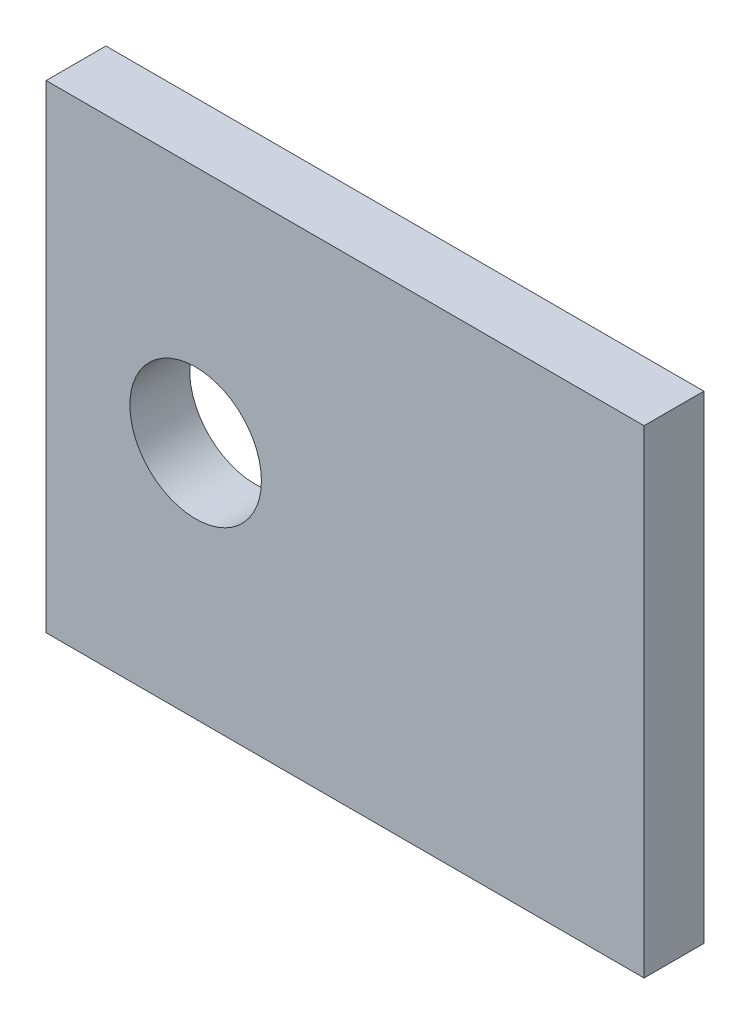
from build123d import *

# Parameters (mm, degrees)
ESQUISSE1_W       = 100
ESQUISSE1_H       = 80
EXTRUSION1_DEPTH  = 10
D_GAGEMENT_M201_D = 22


with BuildPart() as part:
    # Esquisse1 → Extrusion1 (new body)
    with BuildSketch(Plane.XY):
        with Locations((50, 40)):
            Rectangle(ESQUISSE1_W, ESQUISSE1_H)
    extrude(amount=EXTRUSION1_DEPTH)

    # D_gagement M201 (through all)
    with Locations(Plane(origin=(25, 40, 10), x_dir=(1, 0, 0), z_dir=(0, 0, 1))):
        with Locations((0, 0)):
            Hole(D_GAGEMENT_M201_D / 2)


solid = part.part
